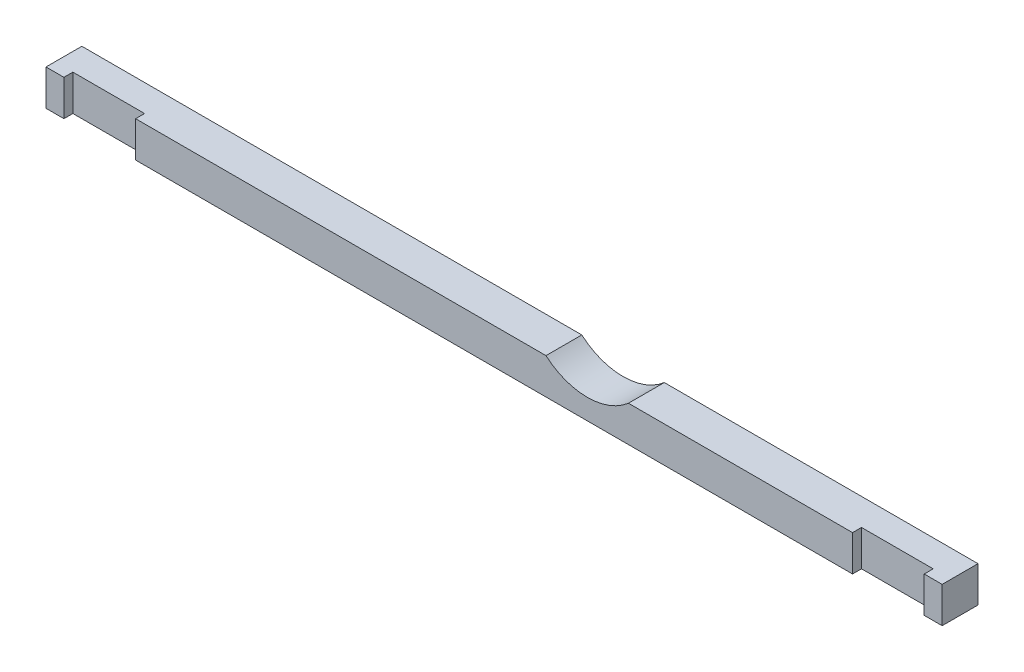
ISO-10303-21;
HEADER;
FILE_DESCRIPTION(('STEP AP214'),'2;1');
FILE_NAME('part.step','',(''),(''),'','','');
FILE_SCHEMA(('AUTOMOTIVE_DESIGN { 1 0 10303 214 1 1 1 1 }'));
ENDSEC;
DATA;
#1=APPLICATION_CONTEXT('core data for automotive mechanical design processes');
#2=APPLICATION_PROTOCOL_DEFINITION('international standard','automotive_design',2000,#1);
#3=PRODUCT_CONTEXT('',#1,'mechanical');
#4=PRODUCT('Part','Part','',(#3));
#5=PRODUCT_RELATED_PRODUCT_CATEGORY('part','',(#4));
#6=PRODUCT_DEFINITION_FORMATION('','',#4);
#7=PRODUCT_DEFINITION_CONTEXT('part definition',#1,'design');
#8=PRODUCT_DEFINITION('design','',#6,#7);
#9=PRODUCT_DEFINITION_SHAPE('','',#8);
#10=(LENGTH_UNIT() NAMED_UNIT(*) SI_UNIT(.MILLI.,.METRE.));
#11=(NAMED_UNIT(*) PLANE_ANGLE_UNIT() SI_UNIT($,.RADIAN.));
#12=(NAMED_UNIT(*) SI_UNIT($,.STERADIAN.) SOLID_ANGLE_UNIT());
#13=UNCERTAINTY_MEASURE_WITH_UNIT(LENGTH_MEASURE(1.E-05),#10,'distance_accuracy_value','');
#14=(GEOMETRIC_REPRESENTATION_CONTEXT(3) GLOBAL_UNCERTAINTY_ASSIGNED_CONTEXT((#13)) GLOBAL_UNIT_ASSIGNED_CONTEXT((#10,
#11,#12)) REPRESENTATION_CONTEXT('',''));
#15=CARTESIAN_POINT('',(0.,0.,0.));
#16=DIRECTION('',(0.,0.,1.));
#17=DIRECTION('',(1.,0.,0.));
#18=AXIS2_PLACEMENT_3D('',#15,#16,#17);
#19=CARTESIAN_POINT('',(0.,10.,0.));
#20=DIRECTION('',(0.,1.,0.));
#21=DIRECTION('',(0.,0.,1.));
#22=AXIS2_PLACEMENT_3D('',#19,#20,#21);
#23=PLANE('',#22);
#24=DIRECTION('',(0.,0.,-1.));
#25=VECTOR('',#24,1.);
#26=CARTESIAN_POINT('',(37.4843424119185,10.,49.4974746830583));
#27=LINE('',#26,#25);
#28=CARTESIAN_POINT('',(37.4843424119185,10.,0.));
#29=VERTEX_POINT('',#28);
#30=CARTESIAN_POINT('',(37.4843424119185,10.,-10.));
#31=VERTEX_POINT('',#30);
#32=EDGE_CURVE('E11',#29,#31,#27,.T.);
#33=ORIENTED_EDGE('',*,*,#32,.F.);
#34=DIRECTION('',(1.,0.,0.));
#35=VECTOR('',#34,1.);
#36=CARTESIAN_POINT('',(-100.,10.,0.));
#37=LINE('',#36,#35);
#38=CARTESIAN_POINT('',(100.,10.,0.));
#39=VERTEX_POINT('',#38);
#40=EDGE_CURVE('E234',#29,#39,#37,.T.);
#41=ORIENTED_EDGE('',*,*,#40,.T.);
#42=DIRECTION('',(0.,0.,-1.));
#43=VECTOR('',#42,1.);
#44=CARTESIAN_POINT('',(100.,10.,-2.5));
#45=LINE('',#44,#43);
#46=CARTESIAN_POINT('',(100.,10.,-2.5));
#47=VERTEX_POINT('',#46);
#48=EDGE_CURVE('E240',#39,#47,#45,.T.);
#49=ORIENTED_EDGE('',*,*,#48,.T.);
#50=DIRECTION('',(1.,0.,0.));
#51=VECTOR('',#50,1.);
#52=CARTESIAN_POINT('',(120.,10.,-2.5));
#53=LINE('',#52,#51);
#54=CARTESIAN_POINT('',(120.,10.,-2.5));
#55=VERTEX_POINT('',#54);
#56=EDGE_CURVE('E242',#47,#55,#53,.T.);
#57=ORIENTED_EDGE('',*,*,#56,.T.);
#58=DIRECTION('',(0.,0.,1.));
#59=VECTOR('',#58,1.);
#60=CARTESIAN_POINT('',(120.,10.,0.));
#61=LINE('',#60,#59);
#62=CARTESIAN_POINT('',(120.,10.,0.));
#63=VERTEX_POINT('',#62);
#64=EDGE_CURVE('E148',#55,#63,#61,.T.);
#65=ORIENTED_EDGE('',*,*,#64,.T.);
#66=DIRECTION('',(1.,0.,0.));
#67=VECTOR('',#66,1.);
#68=CARTESIAN_POINT('',(120.,10.,0.));
#69=LINE('',#68,#67);
#70=CARTESIAN_POINT('',(125.,10.,0.));
#71=VERTEX_POINT('',#70);
#72=EDGE_CURVE('E140',#63,#71,#69,.T.);
#73=ORIENTED_EDGE('',*,*,#72,.T.);
#74=DIRECTION('',(0.,0.,-1.));
#75=VECTOR('',#74,1.);
#76=CARTESIAN_POINT('',(125.,10.,-10.));
#77=LINE('',#76,#75);
#78=CARTESIAN_POINT('',(125.,10.,-10.));
#79=VERTEX_POINT('',#78);
#80=EDGE_CURVE('E145',#71,#79,#77,.T.);
#81=ORIENTED_EDGE('',*,*,#80,.T.);
#82=DIRECTION('',(-1.,0.,0.));
#83=VECTOR('',#82,1.);
#84=CARTESIAN_POINT('',(-125.,10.,-10.));
#85=LINE('',#84,#83);
#86=EDGE_CURVE('E166',#79,#31,#85,.T.);
#87=ORIENTED_EDGE('',*,*,#86,.T.);
#88=EDGE_LOOP('',(#33,#41,#49,#57,#65,#73,#81,#87));
#89=FACE_BOUND('',#88,.T.);
#90=ADVANCED_FACE('F35',(#89),#23,.T.);
#91=CARTESIAN_POINT('',(-125.,10.,-10.));
#92=DIRECTION('',(1.,0.,0.));
#93=DIRECTION('',(0.,0.,-1.));
#94=AXIS2_PLACEMENT_3D('',#91,#92,#93);
#95=PLANE('',#94);
#96=DIRECTION('',(0.,0.,1.));
#97=VECTOR('',#96,1.);
#98=CARTESIAN_POINT('',(-125.,0.,-10.));
#99=LINE('',#98,#97);
#100=CARTESIAN_POINT('',(-125.,0.,-10.));
#101=VERTEX_POINT('',#100);
#102=CARTESIAN_POINT('',(-125.,0.,0.));
#103=VERTEX_POINT('',#102);
#104=EDGE_CURVE('E171',#101,#103,#99,.T.);
#105=ORIENTED_EDGE('',*,*,#104,.T.);
#106=DIRECTION('',(0.,-1.,0.));
#107=VECTOR('',#106,1.);
#108=CARTESIAN_POINT('',(-125.,10.,0.));
#109=LINE('',#108,#107);
#110=CARTESIAN_POINT('',(-125.,10.,0.));
#111=VERTEX_POINT('',#110);
#112=EDGE_CURVE('E220',#111,#103,#109,.T.);
#113=ORIENTED_EDGE('',*,*,#112,.F.);
#114=DIRECTION('',(0.,0.,1.));
#115=VECTOR('',#114,1.);
#116=CARTESIAN_POINT('',(-125.,10.,-10.));
#117=LINE('',#116,#115);
#118=CARTESIAN_POINT('',(-125.,10.,-10.));
#119=VERTEX_POINT('',#118);
#120=EDGE_CURVE('E195',#119,#111,#117,.T.);
#121=ORIENTED_EDGE('',*,*,#120,.F.);
#122=DIRECTION('',(0.,-1.,0.));
#123=VECTOR('',#122,1.);
#124=CARTESIAN_POINT('',(-125.,10.,-10.));
#125=LINE('',#124,#123);
#126=EDGE_CURVE('E170',#119,#101,#125,.T.);
#127=ORIENTED_EDGE('',*,*,#126,.T.);
#128=EDGE_LOOP('',(#105,#113,#121,#127));
#129=FACE_BOUND('',#128,.T.);
#130=ADVANCED_FACE('F37',(#129),#95,.F.);
#131=CARTESIAN_POINT('',(-125.,10.,0.));
#132=DIRECTION('',(0.,0.,-1.));
#133=DIRECTION('',(-1.,0.,0.));
#134=AXIS2_PLACEMENT_3D('',#131,#132,#133);
#135=PLANE('',#134);
#136=DIRECTION('',(1.,0.,0.));
#137=VECTOR('',#136,1.);
#138=CARTESIAN_POINT('',(-125.,0.,0.));
#139=LINE('',#138,#137);
#140=CARTESIAN_POINT('',(-120.,0.,0.));
#141=VERTEX_POINT('',#140);
#142=EDGE_CURVE('E174',#103,#141,#139,.T.);
#143=ORIENTED_EDGE('',*,*,#142,.T.);
#144=DIRECTION('',(0.,-1.,0.));
#145=VECTOR('',#144,1.);
#146=CARTESIAN_POINT('',(-120.,10.,0.));
#147=LINE('',#146,#145);
#148=CARTESIAN_POINT('',(-120.,10.,0.));
#149=VERTEX_POINT('',#148);
#150=EDGE_CURVE('E217',#149,#141,#147,.T.);
#151=ORIENTED_EDGE('',*,*,#150,.F.);
#152=DIRECTION('',(1.,0.,0.));
#153=VECTOR('',#152,1.);
#154=CARTESIAN_POINT('',(-125.,10.,0.));
#155=LINE('',#154,#153);
#156=EDGE_CURVE('E112',#111,#149,#155,.T.);
#157=ORIENTED_EDGE('',*,*,#156,.F.);
#158=ORIENTED_EDGE('',*,*,#112,.T.);
#159=EDGE_LOOP('',(#143,#151,#157,#158));
#160=FACE_BOUND('',#159,.T.);
#161=ADVANCED_FACE('F281',(#160),#135,.F.);
#162=CARTESIAN_POINT('',(-120.,10.,0.));
#163=DIRECTION('',(-1.,0.,0.));
#164=DIRECTION('',(0.,0.,1.));
#165=AXIS2_PLACEMENT_3D('',#162,#163,#164);
#166=PLANE('',#165);
#167=DIRECTION('',(0.,0.,-1.));
#168=VECTOR('',#167,1.);
#169=CARTESIAN_POINT('',(-120.,0.,0.));
#170=LINE('',#169,#168);
#171=CARTESIAN_POINT('',(-120.,0.,-2.5));
#172=VERTEX_POINT('',#171);
#173=EDGE_CURVE('E177',#141,#172,#170,.T.);
#174=ORIENTED_EDGE('',*,*,#173,.T.);
#175=DIRECTION('',(0.,-1.,0.));
#176=VECTOR('',#175,1.);
#177=CARTESIAN_POINT('',(-120.,10.,-2.5));
#178=LINE('',#177,#176);
#179=CARTESIAN_POINT('',(-120.,10.,-2.5));
#180=VERTEX_POINT('',#179);
#181=EDGE_CURVE('E214',#180,#172,#178,.T.);
#182=ORIENTED_EDGE('',*,*,#181,.F.);
#183=DIRECTION('',(0.,0.,-1.));
#184=VECTOR('',#183,1.);
#185=CARTESIAN_POINT('',(-120.,10.,0.));
#186=LINE('',#185,#184);
#187=EDGE_CURVE('E279',#149,#180,#186,.T.);
#188=ORIENTED_EDGE('',*,*,#187,.F.);
#189=ORIENTED_EDGE('',*,*,#150,.T.);
#190=EDGE_LOOP('',(#174,#182,#188,#189));
#191=FACE_BOUND('',#190,.T.);
#192=ADVANCED_FACE('F278',(#191),#166,.F.);
#193=CARTESIAN_POINT('',(-120.,10.,-2.5));
#194=DIRECTION('',(0.,0.,-1.));
#195=DIRECTION('',(-1.,0.,0.));
#196=AXIS2_PLACEMENT_3D('',#193,#194,#195);
#197=PLANE('',#196);
#198=DIRECTION('',(1.,0.,0.));
#199=VECTOR('',#198,1.);
#200=CARTESIAN_POINT('',(-120.,0.,-2.5));
#201=LINE('',#200,#199);
#202=CARTESIAN_POINT('',(-100.,0.,-2.5));
#203=VERTEX_POINT('',#202);
#204=EDGE_CURVE('E179',#172,#203,#201,.T.);
#205=ORIENTED_EDGE('',*,*,#204,.T.);
#206=DIRECTION('',(0.,-1.,0.));
#207=VECTOR('',#206,1.);
#208=CARTESIAN_POINT('',(-100.,10.,-2.5));
#209=LINE('',#208,#207);
#210=CARTESIAN_POINT('',(-100.,10.,-2.5));
#211=VERTEX_POINT('',#210);
#212=EDGE_CURVE('E211',#211,#203,#209,.T.);
#213=ORIENTED_EDGE('',*,*,#212,.F.);
#214=DIRECTION('',(1.,0.,0.));
#215=VECTOR('',#214,1.);
#216=CARTESIAN_POINT('',(-120.,10.,-2.5));
#217=LINE('',#216,#215);
#218=EDGE_CURVE('E274',#180,#211,#217,.T.);
#219=ORIENTED_EDGE('',*,*,#218,.F.);
#220=ORIENTED_EDGE('',*,*,#181,.T.);
#221=EDGE_LOOP('',(#205,#213,#219,#220));
#222=FACE_BOUND('',#221,.T.);
#223=ADVANCED_FACE('F273',(#222),#197,.F.);
#224=CARTESIAN_POINT('',(-100.,10.,-2.5));
#225=DIRECTION('',(1.,0.,0.));
#226=DIRECTION('',(0.,0.,-1.));
#227=AXIS2_PLACEMENT_3D('',#224,#225,#226);
#228=PLANE('',#227);
#229=DIRECTION('',(0.,0.,1.));
#230=VECTOR('',#229,1.);
#231=CARTESIAN_POINT('',(-100.,0.,-2.5));
#232=LINE('',#231,#230);
#233=CARTESIAN_POINT('',(-100.,0.,0.));
#234=VERTEX_POINT('',#233);
#235=EDGE_CURVE('E181',#203,#234,#232,.T.);
#236=ORIENTED_EDGE('',*,*,#235,.T.);
#237=DIRECTION('',(0.,-1.,0.));
#238=VECTOR('',#237,1.);
#239=CARTESIAN_POINT('',(-100.,10.,0.));
#240=LINE('',#239,#238);
#241=CARTESIAN_POINT('',(-100.,10.,0.));
#242=VERTEX_POINT('',#241);
#243=EDGE_CURVE('E208',#242,#234,#240,.T.);
#244=ORIENTED_EDGE('',*,*,#243,.F.);
#245=DIRECTION('',(0.,0.,1.));
#246=VECTOR('',#245,1.);
#247=CARTESIAN_POINT('',(-100.,10.,-2.5));
#248=LINE('',#247,#246);
#249=EDGE_CURVE('E238',#211,#242,#248,.T.);
#250=ORIENTED_EDGE('',*,*,#249,.F.);
#251=ORIENTED_EDGE('',*,*,#212,.T.);
#252=EDGE_LOOP('',(#236,#244,#250,#251));
#253=FACE_BOUND('',#252,.T.);
#254=ADVANCED_FACE('F269',(#253),#228,.F.);
#255=CARTESIAN_POINT('',(-100.,10.,0.));
#256=DIRECTION('',(0.,0.,-1.));
#257=DIRECTION('',(-1.,0.,0.));
#258=AXIS2_PLACEMENT_3D('',#255,#256,#257);
#259=PLANE('',#258);
#260=ORIENTED_EDGE('',*,*,#40,.F.);
#261=CARTESIAN_POINT('',(25.9807621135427,23.1877837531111,0.));
#262=DIRECTION('',(0.,0.,-1.));
#263=DIRECTION('',(-1.,0.,0.));
#264=AXIS2_PLACEMENT_3D('',#261,#262,#263);
#265=CIRCLE('',#264,17.5);
#266=CARTESIAN_POINT('',(14.477181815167,10.,0.));
#267=VERTEX_POINT('',#266);
#268=EDGE_CURVE('E175',#267,#29,#265,.F.);
#269=ORIENTED_EDGE('',*,*,#268,.F.);
#270=EDGE_CURVE('E232',#242,#267,#37,.T.);
#271=ORIENTED_EDGE('',*,*,#270,.F.);
#272=ORIENTED_EDGE('',*,*,#243,.T.);
#273=DIRECTION('',(1.,0.,0.));
#274=VECTOR('',#273,1.);
#275=CARTESIAN_POINT('',(-100.,0.,0.));
#276=LINE('',#275,#274);
#277=CARTESIAN_POINT('',(100.,0.,0.));
#278=VERTEX_POINT('',#277);
#279=EDGE_CURVE('E183',#234,#278,#276,.T.);
#280=ORIENTED_EDGE('',*,*,#279,.T.);
#281=DIRECTION('',(0.,-1.,0.));
#282=VECTOR('',#281,1.);
#283=CARTESIAN_POINT('',(100.,10.,0.));
#284=LINE('',#283,#282);
#285=EDGE_CURVE('E205',#39,#278,#284,.T.);
#286=ORIENTED_EDGE('',*,*,#285,.F.);
#287=EDGE_LOOP('',(#260,#269,#271,#272,#280,#286));
#288=FACE_BOUND('',#287,.T.);
#289=ADVANCED_FACE('F231',(#288),#259,.F.);
#290=CARTESIAN_POINT('',(100.,10.,-2.5));
#291=DIRECTION('',(-1.,0.,0.));
#292=DIRECTION('',(0.,0.,1.));
#293=AXIS2_PLACEMENT_3D('',#290,#291,#292);
#294=PLANE('',#293);
#295=DIRECTION('',(0.,0.,-1.));
#296=VECTOR('',#295,1.);
#297=CARTESIAN_POINT('',(100.,0.,-2.5));
#298=LINE('',#297,#296);
#299=CARTESIAN_POINT('',(100.,0.,-2.5));
#300=VERTEX_POINT('',#299);
#301=EDGE_CURVE('E185',#278,#300,#298,.T.);
#302=ORIENTED_EDGE('',*,*,#301,.T.);
#303=DIRECTION('',(0.,-1.,0.));
#304=VECTOR('',#303,1.);
#305=CARTESIAN_POINT('',(100.,10.,-2.5));
#306=LINE('',#305,#304);
#307=EDGE_CURVE('E202',#47,#300,#306,.T.);
#308=ORIENTED_EDGE('',*,*,#307,.F.);
#309=ORIENTED_EDGE('',*,*,#48,.F.);
#310=ORIENTED_EDGE('',*,*,#285,.T.);
#311=EDGE_LOOP('',(#302,#308,#309,#310));
#312=FACE_BOUND('',#311,.T.);
#313=ADVANCED_FACE('F264',(#312),#294,.F.);
#314=CARTESIAN_POINT('',(120.,10.,-2.5));
#315=DIRECTION('',(0.,0.,-1.));
#316=DIRECTION('',(-1.,0.,0.));
#317=AXIS2_PLACEMENT_3D('',#314,#315,#316);
#318=PLANE('',#317);
#319=DIRECTION('',(1.,0.,0.));
#320=VECTOR('',#319,1.);
#321=CARTESIAN_POINT('',(120.,0.,-2.5));
#322=LINE('',#321,#320);
#323=CARTESIAN_POINT('',(120.,0.,-2.5));
#324=VERTEX_POINT('',#323);
#325=EDGE_CURVE('E187',#300,#324,#322,.T.);
#326=ORIENTED_EDGE('',*,*,#325,.T.);
#327=DIRECTION('',(0.,-1.,0.));
#328=VECTOR('',#327,1.);
#329=CARTESIAN_POINT('',(120.,10.,-2.5));
#330=LINE('',#329,#328);
#331=EDGE_CURVE('E199',#55,#324,#330,.T.);
#332=ORIENTED_EDGE('',*,*,#331,.F.);
#333=ORIENTED_EDGE('',*,*,#56,.F.);
#334=ORIENTED_EDGE('',*,*,#307,.T.);
#335=EDGE_LOOP('',(#326,#332,#333,#334));
#336=FACE_BOUND('',#335,.T.);
#337=ADVANCED_FACE('F252',(#336),#318,.F.);
#338=CARTESIAN_POINT('',(120.,10.,0.));
#339=DIRECTION('',(1.,0.,0.));
#340=DIRECTION('',(0.,0.,-1.));
#341=AXIS2_PLACEMENT_3D('',#338,#339,#340);
#342=PLANE('',#341);
#343=DIRECTION('',(0.,0.,1.));
#344=VECTOR('',#343,1.);
#345=CARTESIAN_POINT('',(120.,0.,0.));
#346=LINE('',#345,#344);
#347=CARTESIAN_POINT('',(120.,0.,0.));
#348=VERTEX_POINT('',#347);
#349=EDGE_CURVE('E189',#324,#348,#346,.T.);
#350=ORIENTED_EDGE('',*,*,#349,.T.);
#351=DIRECTION('',(0.,-1.,0.));
#352=VECTOR('',#351,1.);
#353=CARTESIAN_POINT('',(120.,10.,0.));
#354=LINE('',#353,#352);
#355=EDGE_CURVE('E160',#63,#348,#354,.T.);
#356=ORIENTED_EDGE('',*,*,#355,.F.);
#357=ORIENTED_EDGE('',*,*,#64,.F.);
#358=ORIENTED_EDGE('',*,*,#331,.T.);
#359=EDGE_LOOP('',(#350,#356,#357,#358));
#360=FACE_BOUND('',#359,.T.);
#361=ADVANCED_FACE('F256',(#360),#342,.F.);
#362=CARTESIAN_POINT('',(120.,10.,0.));
#363=DIRECTION('',(0.,0.,-1.));
#364=DIRECTION('',(-1.,0.,0.));
#365=AXIS2_PLACEMENT_3D('',#362,#363,#364);
#366=PLANE('',#365);
#367=DIRECTION('',(1.,0.,0.));
#368=VECTOR('',#367,1.);
#369=CARTESIAN_POINT('',(120.,0.,0.));
#370=LINE('',#369,#368);
#371=CARTESIAN_POINT('',(125.,0.,0.));
#372=VERTEX_POINT('',#371);
#373=EDGE_CURVE('E157',#348,#372,#370,.T.);
#374=ORIENTED_EDGE('',*,*,#373,.T.);
#375=DIRECTION('',(0.,-1.,0.));
#376=VECTOR('',#375,1.);
#377=CARTESIAN_POINT('',(125.,10.,0.));
#378=LINE('',#377,#376);
#379=EDGE_CURVE('E154',#71,#372,#378,.T.);
#380=ORIENTED_EDGE('',*,*,#379,.F.);
#381=ORIENTED_EDGE('',*,*,#72,.F.);
#382=ORIENTED_EDGE('',*,*,#355,.T.);
#383=EDGE_LOOP('',(#374,#380,#381,#382));
#384=FACE_BOUND('',#383,.T.);
#385=ADVANCED_FACE('F155',(#384),#366,.F.);
#386=CARTESIAN_POINT('',(125.,10.,-10.));
#387=DIRECTION('',(-1.,0.,0.));
#388=DIRECTION('',(0.,0.,1.));
#389=AXIS2_PLACEMENT_3D('',#386,#387,#388);
#390=PLANE('',#389);
#391=DIRECTION('',(0.,0.,-1.));
#392=VECTOR('',#391,1.);
#393=CARTESIAN_POINT('',(125.,0.,-10.));
#394=LINE('',#393,#392);
#395=CARTESIAN_POINT('',(125.,0.,-10.));
#396=VERTEX_POINT('',#395);
#397=EDGE_CURVE('E192',#372,#396,#394,.T.);
#398=ORIENTED_EDGE('',*,*,#397,.T.);
#399=DIRECTION('',(0.,-1.,0.));
#400=VECTOR('',#399,1.);
#401=CARTESIAN_POINT('',(125.,10.,-10.));
#402=LINE('',#401,#400);
#403=EDGE_CURVE('E161',#79,#396,#402,.T.);
#404=ORIENTED_EDGE('',*,*,#403,.F.);
#405=ORIENTED_EDGE('',*,*,#80,.F.);
#406=ORIENTED_EDGE('',*,*,#379,.T.);
#407=EDGE_LOOP('',(#398,#404,#405,#406));
#408=FACE_BOUND('',#407,.T.);
#409=ADVANCED_FACE('F163',(#408),#390,.F.);
#410=CARTESIAN_POINT('',(-125.,10.,-10.));
#411=DIRECTION('',(0.,0.,1.));
#412=DIRECTION('',(1.,0.,0.));
#413=AXIS2_PLACEMENT_3D('',#410,#411,#412);
#414=PLANE('',#413);
#415=CARTESIAN_POINT('',(14.477181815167,10.,-10.));
#416=VERTEX_POINT('',#415);
#417=EDGE_CURVE('E57',#416,#119,#85,.T.);
#418=ORIENTED_EDGE('',*,*,#417,.F.);
#419=CARTESIAN_POINT('',(25.9807621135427,23.1877837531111,-10.));
#420=DIRECTION('',(0.,0.,-1.));
#421=DIRECTION('',(-1.,0.,0.));
#422=AXIS2_PLACEMENT_3D('',#419,#420,#421);
#423=CIRCLE('',#422,17.5);
#424=EDGE_CURVE('E49',#31,#416,#423,.T.);
#425=ORIENTED_EDGE('',*,*,#424,.F.);
#426=ORIENTED_EDGE('',*,*,#86,.F.);
#427=ORIENTED_EDGE('',*,*,#403,.T.);
#428=DIRECTION('',(-1.,0.,0.));
#429=VECTOR('',#428,1.);
#430=CARTESIAN_POINT('',(-125.,0.,-10.));
#431=LINE('',#430,#429);
#432=EDGE_CURVE('E103',#396,#101,#431,.T.);
#433=ORIENTED_EDGE('',*,*,#432,.T.);
#434=ORIENTED_EDGE('',*,*,#126,.F.);
#435=EDGE_LOOP('',(#418,#425,#426,#427,#433,#434));
#436=FACE_BOUND('',#435,.T.);
#437=ADVANCED_FACE('F260',(#436),#414,.F.);
#438=DIRECTION('',(0.,0.,-1.));
#439=VECTOR('',#438,1.);
#440=CARTESIAN_POINT('',(14.477181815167,10.,49.4974746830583));
#441=LINE('',#440,#439);
#442=EDGE_CURVE('E43',#416,#267,#441,.F.);
#443=ORIENTED_EDGE('',*,*,#442,.F.);
#444=ORIENTED_EDGE('',*,*,#417,.T.);
#445=ORIENTED_EDGE('',*,*,#120,.T.);
#446=ORIENTED_EDGE('',*,*,#156,.T.);
#447=ORIENTED_EDGE('',*,*,#187,.T.);
#448=ORIENTED_EDGE('',*,*,#218,.T.);
#449=ORIENTED_EDGE('',*,*,#249,.T.);
#450=ORIENTED_EDGE('',*,*,#270,.T.);
#451=EDGE_LOOP('',(#443,#444,#445,#446,#447,#448,#449,#450));
#452=FACE_BOUND('',#451,.T.);
#453=ADVANCED_FACE('F236',(#452),#23,.T.);
#454=CARTESIAN_POINT('',(0.,0.,0.));
#455=DIRECTION('',(0.,1.,0.));
#456=DIRECTION('',(0.,0.,1.));
#457=AXIS2_PLACEMENT_3D('',#454,#455,#456);
#458=PLANE('',#457);
#459=ORIENTED_EDGE('',*,*,#104,.F.);
#460=ORIENTED_EDGE('',*,*,#432,.F.);
#461=ORIENTED_EDGE('',*,*,#397,.F.);
#462=ORIENTED_EDGE('',*,*,#373,.F.);
#463=ORIENTED_EDGE('',*,*,#349,.F.);
#464=ORIENTED_EDGE('',*,*,#325,.F.);
#465=ORIENTED_EDGE('',*,*,#301,.F.);
#466=ORIENTED_EDGE('',*,*,#279,.F.);
#467=ORIENTED_EDGE('',*,*,#235,.F.);
#468=ORIENTED_EDGE('',*,*,#204,.F.);
#469=ORIENTED_EDGE('',*,*,#173,.F.);
#470=ORIENTED_EDGE('',*,*,#142,.F.);
#471=EDGE_LOOP('',(#459,#460,#461,#462,#463,#464,#465,#466,#467,#468,#469,#470));
#472=FACE_BOUND('',#471,.T.);
#473=ADVANCED_FACE('F259',(#472),#458,.F.);
#474=CARTESIAN_POINT('',(25.9807621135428,23.1877837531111,49.4974746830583));
#475=DIRECTION('',(0.,0.,-1.));
#476=DIRECTION('',(-1.,0.,0.));
#477=AXIS2_PLACEMENT_3D('',#474,#475,#476);
#478=CYLINDRICAL_SURFACE('',#477,17.5);
#479=ORIENTED_EDGE('',*,*,#32,.T.);
#480=ORIENTED_EDGE('',*,*,#424,.T.);
#481=ORIENTED_EDGE('',*,*,#442,.T.);
#482=ORIENTED_EDGE('',*,*,#268,.T.);
#483=EDGE_LOOP('',(#479,#480,#481,#482));
#484=FACE_BOUND('',#483,.T.);
#485=ADVANCED_FACE('F224',(#484),#478,.F.);
#486=CLOSED_SHELL('',(#90,#130,#161,#192,#223,#254,#289,#313,#337,#361,#385,#409,#437,#453,#473,#485));
#487=MANIFOLD_SOLID_BREP('B2',#486);
#488=ADVANCED_BREP_SHAPE_REPRESENTATION('',(#18,#487),#14);
#489=SHAPE_DEFINITION_REPRESENTATION(#9,#488);
ENDSEC;
END-ISO-10303-21;
